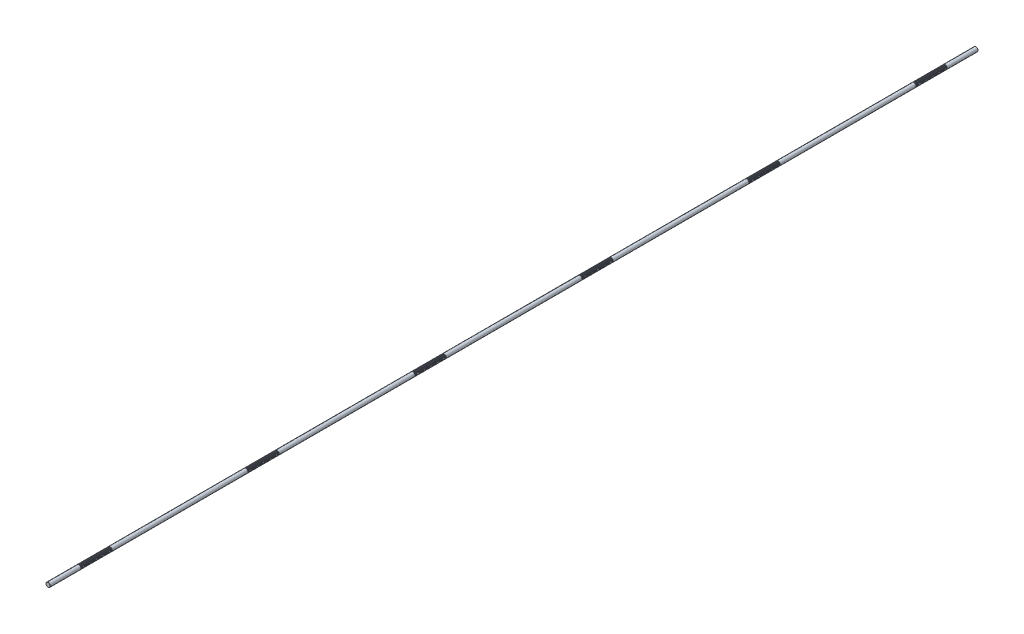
from build123d import *

# Parameters (mm, degrees)
SKETCH1_R           = 7
BOSS_EXTRUDE1_DEPTH = 1500
CHAMFER1_SIZE       = 0.35
LPATTERN1_COUNT     = 34
LPATTERN1_PITCH     = 3
LPATTERN2_COUNT     = 6
LPATTERN2_PITCH     = 540


with BuildPart() as part:
    # Sketch1 → Boss-Extrude1 (new, symmetric)
    with BuildSketch(Plane.XY):
        Circle(SKETCH1_R)
    extrude(amount=BOSS_EXTRUDE1_DEPTH, both=True)

    # Chamfer1
    chamfer1_edges = [part.edges().sort_by_distance(p)[0] for p in [
        (-7, 0, -1500),
        (-7, 0, 1500),
    ]]
    chamfer(chamfer1_edges, length=CHAMFER1_SIZE)

    # Sketch2 → Cut-Revolve1 (revolve, cut)
    with BuildSketch(Plane(origin=(0, 0, 0), x_dir=(0, 0, -1), z_dir=(1, 0, 0)), mode=Mode.PRIVATE) as cut_revolve1_sk:
        Polygon((1400.234455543, 7), (1398.265544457, 7), (1398.734455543, 5.25), (1399.765544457, 5.25), align=None)
    cut_revolve1 = revolve(cut_revolve1_sk.sketch.rotate(Axis((0, 0, 1500), (0, 0, -1)), 90), axis=Axis((0, 0, 1500), (0, 0, -1)), mode=Mode.SUBTRACT)

    # LPattern1: Cut-Revolve1 ×34
    with Locations(*[(0, 0, i * LPATTERN1_PITCH) for i in range(1, LPATTERN1_COUNT)]):
        add(cut_revolve1, mode=Mode.SUBTRACT)

    # LPattern2: Cut-Revolve1 ×6
    with Locations(*[(0, 0, i * LPATTERN2_PITCH) for i in range(1, LPATTERN2_COUNT)]):
        add(cut_revolve1, mode=Mode.SUBTRACT)

    # LPattern2 copy 1 sketch → LPattern2 copy 1 (revolve, cut)
    with BuildSketch(Plane(origin=(0, 0, 543), x_dir=(0, 0, -1), z_dir=(1, 0, 0))):
        Polygon((1400.234455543, 7), (1398.265544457, 7), (1398.734455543, 5.25), (1399.765544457, 5.25), align=None)
    revolve(axis=Axis((0, 0, 2043), (0, 0, -1)), mode=Mode.SUBTRACT)

    # LPattern2 copy 2 sketch → LPattern2 copy 2 (revolve, cut)
    with BuildSketch(Plane(origin=(0, 0, 1083), x_dir=(0, 0, -1), z_dir=(1, 0, 0))):
        Polygon((1400.234455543, 7), (1398.265544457, 7), (1398.734455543, 5.25), (1399.765544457, 5.25), align=None)
    revolve(axis=Axis((0, 0, 2583), (0, 0, -1)), mode=Mode.SUBTRACT)

    # LPattern2 copy 3 sketch → LPattern2 copy 3 (revolve, cut)
    with BuildSketch(Plane(origin=(0, 0, 1623), x_dir=(0, 0, -1), z_dir=(1, 0, 0))):
        Polygon((1400.234455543, 7), (1398.265544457, 7), (1398.734455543, 5.25), (1399.765544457, 5.25), align=None)
    revolve(axis=Axis((0, 0, 3123), (0, 0, -1)), mode=Mode.SUBTRACT)

    # LPattern2 copy 4 sketch → LPattern2 copy 4 (revolve, cut)
    with BuildSketch(Plane(origin=(0, 0, 2163), x_dir=(0, 0, -1), z_dir=(1, 0, 0))):
        Polygon((1400.234455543, 7), (1398.265544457, 7), (1398.734455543, 5.25), (1399.765544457, 5.25), align=None)
    revolve(axis=Axis((0, 0, 3663), (0, 0, -1)), mode=Mode.SUBTRACT)

    # LPattern2 copy 5 sketch → LPattern2 copy 5 (revolve, cut)
    with BuildSketch(Plane(origin=(0, 0, 2703), x_dir=(0, 0, -1), z_dir=(1, 0, 0))):
        Polygon((1400.234455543, 7), (1398.265544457, 7), (1398.734455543, 5.25), (1399.765544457, 5.25), align=None)
    revolve(axis=Axis((0, 0, 4203), (0, 0, -1)), mode=Mode.SUBTRACT)

    # LPattern2 copy 6 sketch → LPattern2 copy 6 (revolve, cut)
    with BuildSketch(Plane(origin=(0, 0, 546), x_dir=(0, 0, -1), z_dir=(1, 0, 0))):
        Polygon((1400.234455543, 7), (1398.265544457, 7), (1398.734455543, 5.25), (1399.765544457, 5.25), align=None)
    revolve(axis=Axis((0, 0, 2046), (0, 0, -1)), mode=Mode.SUBTRACT)

    # LPattern2 copy 7 sketch → LPattern2 copy 7 (revolve, cut)
    with BuildSketch(Plane(origin=(0, 0, 1086), x_dir=(0, 0, -1), z_dir=(1, 0, 0))):
        Polygon((1400.234455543, 7), (1398.265544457, 7), (1398.734455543, 5.25), (1399.765544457, 5.25), align=None)
    revolve(axis=Axis((0, 0, 2586), (0, 0, -1)), mode=Mode.SUBTRACT)

    # LPattern2 copy 8 sketch → LPattern2 copy 8 (revolve, cut)
    with BuildSketch(Plane(origin=(0, 0, 1626), x_dir=(0, 0, -1), z_dir=(1, 0, 0))):
        Polygon((1400.234455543, 7), (1398.265544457, 7), (1398.734455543, 5.25), (1399.765544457, 5.25), align=None)
    revolve(axis=Axis((0, 0, 3126), (0, 0, -1)), mode=Mode.SUBTRACT)

    # LPattern2 copy 9 sketch → LPattern2 copy 9 (revolve, cut)
    with BuildSketch(Plane(origin=(0, 0, 2166), x_dir=(0, 0, -1), z_dir=(1, 0, 0))):
        Polygon((1400.234455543, 7), (1398.265544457, 7), (1398.734455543, 5.25), (1399.765544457, 5.25), align=None)
    revolve(axis=Axis((0, 0, 3666), (0, 0, -1)), mode=Mode.SUBTRACT)

    # LPattern2 copy 10 sketch → LPattern2 copy 10 (revolve, cut)
    with BuildSketch(Plane(origin=(0, 0, 2706), x_dir=(0, 0, -1), z_dir=(1, 0, 0))):
        Polygon((1400.234455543, 7), (1398.265544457, 7), (1398.734455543, 5.25), (1399.765544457, 5.25), align=None)
    revolve(axis=Axis((0, 0, 4206), (0, 0, -1)), mode=Mode.SUBTRACT)

    # LPattern2 copy 11 sketch → LPattern2 copy 11 (revolve, cut)
    with BuildSketch(Plane(origin=(0, 0, 549), x_dir=(0, 0, -1), z_dir=(1, 0, 0))):
        Polygon((1400.234455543, 7), (1398.265544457, 7), (1398.734455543, 5.25), (1399.765544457, 5.25), align=None)
    revolve(axis=Axis((0, 0, 2049), (0, 0, -1)), mode=Mode.SUBTRACT)

    # LPattern2 copy 12 sketch → LPattern2 copy 12 (revolve, cut)
    with BuildSketch(Plane(origin=(0, 0, 1089), x_dir=(0, 0, -1), z_dir=(1, 0, 0))):
        Polygon((1400.234455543, 7), (1398.265544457, 7), (1398.734455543, 5.25), (1399.765544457, 5.25), align=None)
    revolve(axis=Axis((0, 0, 2589), (0, 0, -1)), mode=Mode.SUBTRACT)

    # LPattern2 copy 13 sketch → LPattern2 copy 13 (revolve, cut)
    with BuildSketch(Plane(origin=(0, 0, 1629), x_dir=(0, 0, -1), z_dir=(1, 0, 0))):
        Polygon((1400.234455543, 7), (1398.265544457, 7), (1398.734455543, 5.25), (1399.765544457, 5.25), align=None)
    revolve(axis=Axis((0, 0, 3129), (0, 0, -1)), mode=Mode.SUBTRACT)

    # LPattern2 copy 14 sketch → LPattern2 copy 14 (revolve, cut)
    with BuildSketch(Plane(origin=(0, 0, 2169), x_dir=(0, 0, -1), z_dir=(1, 0, 0))):
        Polygon((1400.234455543, 7), (1398.265544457, 7), (1398.734455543, 5.25), (1399.765544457, 5.25), align=None)
    revolve(axis=Axis((0, 0, 3669), (0, 0, -1)), mode=Mode.SUBTRACT)

    # LPattern2 copy 15 sketch → LPattern2 copy 15 (revolve, cut)
    with BuildSketch(Plane(origin=(0, 0, 2709), x_dir=(0, 0, -1), z_dir=(1, 0, 0))):
        Polygon((1400.234455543, 7), (1398.265544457, 7), (1398.734455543, 5.25), (1399.765544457, 5.25), align=None)
    revolve(axis=Axis((0, 0, 4209), (0, 0, -1)), mode=Mode.SUBTRACT)

    # LPattern2 copy 16 sketch → LPattern2 copy 16 (revolve, cut)
    with BuildSketch(Plane(origin=(0, 0, 552), x_dir=(0, 0, -1), z_dir=(1, 0, 0))):
        Polygon((1400.234455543, 7), (1398.265544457, 7), (1398.734455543, 5.25), (1399.765544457, 5.25), align=None)
    revolve(axis=Axis((0, 0, 2052), (0, 0, -1)), mode=Mode.SUBTRACT)

    # LPattern2 copy 17 sketch → LPattern2 copy 17 (revolve, cut)
    with BuildSketch(Plane(origin=(0, 0, 1092), x_dir=(0, 0, -1), z_dir=(1, 0, 0))):
        Polygon((1400.234455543, 7), (1398.265544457, 7), (1398.734455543, 5.25), (1399.765544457, 5.25), align=None)
    revolve(axis=Axis((0, 0, 2592), (0, 0, -1)), mode=Mode.SUBTRACT)

    # LPattern2 copy 18 sketch → LPattern2 copy 18 (revolve, cut)
    with BuildSketch(Plane(origin=(0, 0, 1632), x_dir=(0, 0, -1), z_dir=(1, 0, 0))):
        Polygon((1400.234455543, 7), (1398.265544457, 7), (1398.734455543, 5.25), (1399.765544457, 5.25), align=None)
    revolve(axis=Axis((0, 0, 3132), (0, 0, -1)), mode=Mode.SUBTRACT)

    # LPattern2 copy 19 sketch → LPattern2 copy 19 (revolve, cut)
    with BuildSketch(Plane(origin=(0, 0, 2172), x_dir=(0, 0, -1), z_dir=(1, 0, 0))):
        Polygon((1400.234455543, 7), (1398.265544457, 7), (1398.734455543, 5.25), (1399.765544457, 5.25), align=None)
    revolve(axis=Axis((0, 0, 3672), (0, 0, -1)), mode=Mode.SUBTRACT)

    # LPattern2 copy 20 sketch → LPattern2 copy 20 (revolve, cut)
    with BuildSketch(Plane(origin=(0, 0, 2712), x_dir=(0, 0, -1), z_dir=(1, 0, 0))):
        Polygon((1400.234455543, 7), (1398.265544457, 7), (1398.734455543, 5.25), (1399.765544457, 5.25), align=None)
    revolve(axis=Axis((0, 0, 4212), (0, 0, -1)), mode=Mode.SUBTRACT)

    # LPattern2 copy 21 sketch → LPattern2 copy 21 (revolve, cut)
    with BuildSketch(Plane(origin=(0, 0, 555), x_dir=(0, 0, -1), z_dir=(1, 0, 0))):
        Polygon((1400.234455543, 7), (1398.265544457, 7), (1398.734455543, 5.25), (1399.765544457, 5.25), align=None)
    revolve(axis=Axis((0, 0, 2055), (0, 0, -1)), mode=Mode.SUBTRACT)

    # LPattern2 copy 22 sketch → LPattern2 copy 22 (revolve, cut)
    with BuildSketch(Plane(origin=(0, 0, 1095), x_dir=(0, 0, -1), z_dir=(1, 0, 0))):
        Polygon((1400.234455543, 7), (1398.265544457, 7), (1398.734455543, 5.25), (1399.765544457, 5.25), align=None)
    revolve(axis=Axis((0, 0, 2595), (0, 0, -1)), mode=Mode.SUBTRACT)

    # LPattern2 copy 23 sketch → LPattern2 copy 23 (revolve, cut)
    with BuildSketch(Plane(origin=(0, 0, 1635), x_dir=(0, 0, -1), z_dir=(1, 0, 0))):
        Polygon((1400.234455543, 7), (1398.265544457, 7), (1398.734455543, 5.25), (1399.765544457, 5.25), align=None)
    revolve(axis=Axis((0, 0, 3135), (0, 0, -1)), mode=Mode.SUBTRACT)

    # LPattern2 copy 24 sketch → LPattern2 copy 24 (revolve, cut)
    with BuildSketch(Plane(origin=(0, 0, 2175), x_dir=(0, 0, -1), z_dir=(1, 0, 0))):
        Polygon((1400.234455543, 7), (1398.265544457, 7), (1398.734455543, 5.25), (1399.765544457, 5.25), align=None)
    revolve(axis=Axis((0, 0, 3675), (0, 0, -1)), mode=Mode.SUBTRACT)

    # LPattern2 copy 25 sketch → LPattern2 copy 25 (revolve, cut)
    with BuildSketch(Plane(origin=(0, 0, 2715), x_dir=(0, 0, -1), z_dir=(1, 0, 0))):
        Polygon((1400.234455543, 7), (1398.265544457, 7), (1398.734455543, 5.25), (1399.765544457, 5.25), align=None)
    revolve(axis=Axis((0, 0, 4215), (0, 0, -1)), mode=Mode.SUBTRACT)

    # LPattern2 copy 26 sketch → LPattern2 copy 26 (revolve, cut)
    with BuildSketch(Plane(origin=(0, 0, 558), x_dir=(0, 0, -1), z_dir=(1, 0, 0))):
        Polygon((1400.234455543, 7), (1398.265544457, 7), (1398.734455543, 5.25), (1399.765544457, 5.25), align=None)
    revolve(axis=Axis((0, 0, 2058), (0, 0, -1)), mode=Mode.SUBTRACT)

    # LPattern2 copy 27 sketch → LPattern2 copy 27 (revolve, cut)
    with BuildSketch(Plane(origin=(0, 0, 1098), x_dir=(0, 0, -1), z_dir=(1, 0, 0))):
        Polygon((1400.234455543, 7), (1398.265544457, 7), (1398.734455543, 5.25), (1399.765544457, 5.25), align=None)
    revolve(axis=Axis((0, 0, 2598), (0, 0, -1)), mode=Mode.SUBTRACT)

    # LPattern2 copy 28 sketch → LPattern2 copy 28 (revolve, cut)
    with BuildSketch(Plane(origin=(0, 0, 1638), x_dir=(0, 0, -1), z_dir=(1, 0, 0))):
        Polygon((1400.234455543, 7), (1398.265544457, 7), (1398.734455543, 5.25), (1399.765544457, 5.25), align=None)
    revolve(axis=Axis((0, 0, 3138), (0, 0, -1)), mode=Mode.SUBTRACT)

    # LPattern2 copy 29 sketch → LPattern2 copy 29 (revolve, cut)
    with BuildSketch(Plane(origin=(0, 0, 2178), x_dir=(0, 0, -1), z_dir=(1, 0, 0))):
        Polygon((1400.234455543, 7), (1398.265544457, 7), (1398.734455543, 5.25), (1399.765544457, 5.25), align=None)
    revolve(axis=Axis((0, 0, 3678), (0, 0, -1)), mode=Mode.SUBTRACT)

    # LPattern2 copy 30 sketch → LPattern2 copy 30 (revolve, cut)
    with BuildSketch(Plane(origin=(0, 0, 2718), x_dir=(0, 0, -1), z_dir=(1, 0, 0))):
        Polygon((1400.234455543, 7), (1398.265544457, 7), (1398.734455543, 5.25), (1399.765544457, 5.25), align=None)
    revolve(axis=Axis((0, 0, 4218), (0, 0, -1)), mode=Mode.SUBTRACT)

    # LPattern2 copy 31 sketch → LPattern2 copy 31 (revolve, cut)
    with BuildSketch(Plane(origin=(0, 0, 561), x_dir=(0, 0, -1), z_dir=(1, 0, 0))):
        Polygon((1400.234455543, 7), (1398.265544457, 7), (1398.734455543, 5.25), (1399.765544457, 5.25), align=None)
    revolve(axis=Axis((0, 0, 2061), (0, 0, -1)), mode=Mode.SUBTRACT)

    # LPattern2 copy 32 sketch → LPattern2 copy 32 (revolve, cut)
    with BuildSketch(Plane(origin=(0, 0, 1101), x_dir=(0, 0, -1), z_dir=(1, 0, 0))):
        Polygon((1400.234455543, 7), (1398.265544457, 7), (1398.734455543, 5.25), (1399.765544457, 5.25), align=None)
    revolve(axis=Axis((0, 0, 2601), (0, 0, -1)), mode=Mode.SUBTRACT)

    # LPattern2 copy 33 sketch → LPattern2 copy 33 (revolve, cut)
    with BuildSketch(Plane(origin=(0, 0, 1641), x_dir=(0, 0, -1), z_dir=(1, 0, 0))):
        Polygon((1400.234455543, 7), (1398.265544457, 7), (1398.734455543, 5.25), (1399.765544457, 5.25), align=None)
    revolve(axis=Axis((0, 0, 3141), (0, 0, -1)), mode=Mode.SUBTRACT)

    # LPattern2 copy 34 sketch → LPattern2 copy 34 (revolve, cut)
    with BuildSketch(Plane(origin=(0, 0, 2181), x_dir=(0, 0, -1), z_dir=(1, 0, 0))):
        Polygon((1400.234455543, 7), (1398.265544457, 7), (1398.734455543, 5.25), (1399.765544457, 5.25), align=None)
    revolve(axis=Axis((0, 0, 3681), (0, 0, -1)), mode=Mode.SUBTRACT)

    # LPattern2 copy 35 sketch → LPattern2 copy 35 (revolve, cut)
    with BuildSketch(Plane(origin=(0, 0, 2721), x_dir=(0, 0, -1), z_dir=(1, 0, 0))):
        Polygon((1400.234455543, 7), (1398.265544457, 7), (1398.734455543, 5.25), (1399.765544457, 5.25), align=None)
    revolve(axis=Axis((0, 0, 4221), (0, 0, -1)), mode=Mode.SUBTRACT)

    # LPattern2 copy 36 sketch → LPattern2 copy 36 (revolve, cut)
    with BuildSketch(Plane(origin=(0, 0, 564), x_dir=(0, 0, -1), z_dir=(1, 0, 0))):
        Polygon((1400.234455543, 7), (1398.265544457, 7), (1398.734455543, 5.25), (1399.765544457, 5.25), align=None)
    revolve(axis=Axis((0, 0, 2064), (0, 0, -1)), mode=Mode.SUBTRACT)

    # LPattern2 copy 37 sketch → LPattern2 copy 37 (revolve, cut)
    with BuildSketch(Plane(origin=(0, 0, 1104), x_dir=(0, 0, -1), z_dir=(1, 0, 0))):
        Polygon((1400.234455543, 7), (1398.265544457, 7), (1398.734455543, 5.25), (1399.765544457, 5.25), align=None)
    revolve(axis=Axis((0, 0, 2604), (0, 0, -1)), mode=Mode.SUBTRACT)

    # LPattern2 copy 38 sketch → LPattern2 copy 38 (revolve, cut)
    with BuildSketch(Plane(origin=(0, 0, 1644), x_dir=(0, 0, -1), z_dir=(1, 0, 0))):
        Polygon((1400.234455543, 7), (1398.265544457, 7), (1398.734455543, 5.25), (1399.765544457, 5.25), align=None)
    revolve(axis=Axis((0, 0, 3144), (0, 0, -1)), mode=Mode.SUBTRACT)

    # LPattern2 copy 39 sketch → LPattern2 copy 39 (revolve, cut)
    with BuildSketch(Plane(origin=(0, 0, 2184), x_dir=(0, 0, -1), z_dir=(1, 0, 0))):
        Polygon((1400.234455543, 7), (1398.265544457, 7), (1398.734455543, 5.25), (1399.765544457, 5.25), align=None)
    revolve(axis=Axis((0, 0, 3684), (0, 0, -1)), mode=Mode.SUBTRACT)

    # LPattern2 copy 40 sketch → LPattern2 copy 40 (revolve, cut)
    with BuildSketch(Plane(origin=(0, 0, 2724), x_dir=(0, 0, -1), z_dir=(1, 0, 0))):
        Polygon((1400.234455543, 7), (1398.265544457, 7), (1398.734455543, 5.25), (1399.765544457, 5.25), align=None)
    revolve(axis=Axis((0, 0, 4224), (0, 0, -1)), mode=Mode.SUBTRACT)

    # LPattern2 copy 41 sketch → LPattern2 copy 41 (revolve, cut)
    with BuildSketch(Plane(origin=(0, 0, 567), x_dir=(0, 0, -1), z_dir=(1, 0, 0))):
        Polygon((1400.234455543, 7), (1398.265544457, 7), (1398.734455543, 5.25), (1399.765544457, 5.25), align=None)
    revolve(axis=Axis((0, 0, 2067), (0, 0, -1)), mode=Mode.SUBTRACT)

    # LPattern2 copy 42 sketch → LPattern2 copy 42 (revolve, cut)
    with BuildSketch(Plane(origin=(0, 0, 1107), x_dir=(0, 0, -1), z_dir=(1, 0, 0))):
        Polygon((1400.234455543, 7), (1398.265544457, 7), (1398.734455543, 5.25), (1399.765544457, 5.25), align=None)
    revolve(axis=Axis((0, 0, 2607), (0, 0, -1)), mode=Mode.SUBTRACT)

    # LPattern2 copy 43 sketch → LPattern2 copy 43 (revolve, cut)
    with BuildSketch(Plane(origin=(0, 0, 1647), x_dir=(0, 0, -1), z_dir=(1, 0, 0))):
        Polygon((1400.234455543, 7), (1398.265544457, 7), (1398.734455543, 5.25), (1399.765544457, 5.25), align=None)
    revolve(axis=Axis((0, 0, 3147), (0, 0, -1)), mode=Mode.SUBTRACT)

    # LPattern2 copy 44 sketch → LPattern2 copy 44 (revolve, cut)
    with BuildSketch(Plane(origin=(0, 0, 2187), x_dir=(0, 0, -1), z_dir=(1, 0, 0))):
        Polygon((1400.234455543, 7), (1398.265544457, 7), (1398.734455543, 5.25), (1399.765544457, 5.25), align=None)
    revolve(axis=Axis((0, 0, 3687), (0, 0, -1)), mode=Mode.SUBTRACT)

    # LPattern2 copy 45 sketch → LPattern2 copy 45 (revolve, cut)
    with BuildSketch(Plane(origin=(0, 0, 2727), x_dir=(0, 0, -1), z_dir=(1, 0, 0))):
        Polygon((1400.234455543, 7), (1398.265544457, 7), (1398.734455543, 5.25), (1399.765544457, 5.25), align=None)
    revolve(axis=Axis((0, 0, 4227), (0, 0, -1)), mode=Mode.SUBTRACT)

    # LPattern2 copy 46 sketch → LPattern2 copy 46 (revolve, cut)
    with BuildSketch(Plane(origin=(0, 0, 570), x_dir=(0, 0, -1), z_dir=(1, 0, 0))):
        Polygon((1400.234455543, 7), (1398.265544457, 7), (1398.734455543, 5.25), (1399.765544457, 5.25), align=None)
    revolve(axis=Axis((0, 0, 2070), (0, 0, -1)), mode=Mode.SUBTRACT)

    # LPattern2 copy 47 sketch → LPattern2 copy 47 (revolve, cut)
    with BuildSketch(Plane(origin=(0, 0, 1110), x_dir=(0, 0, -1), z_dir=(1, 0, 0))):
        Polygon((1400.234455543, 7), (1398.265544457, 7), (1398.734455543, 5.25), (1399.765544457, 5.25), align=None)
    revolve(axis=Axis((0, 0, 2610), (0, 0, -1)), mode=Mode.SUBTRACT)

    # LPattern2 copy 48 sketch → LPattern2 copy 48 (revolve, cut)
    with BuildSketch(Plane(origin=(0, 0, 1650), x_dir=(0, 0, -1), z_dir=(1, 0, 0))):
        Polygon((1400.234455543, 7), (1398.265544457, 7), (1398.734455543, 5.25), (1399.765544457, 5.25), align=None)
    revolve(axis=Axis((0, 0, 3150), (0, 0, -1)), mode=Mode.SUBTRACT)

    # LPattern2 copy 49 sketch → LPattern2 copy 49 (revolve, cut)
    with BuildSketch(Plane(origin=(0, 0, 2190), x_dir=(0, 0, -1), z_dir=(1, 0, 0))):
        Polygon((1400.234455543, 7), (1398.265544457, 7), (1398.734455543, 5.25), (1399.765544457, 5.25), align=None)
    revolve(axis=Axis((0, 0, 3690), (0, 0, -1)), mode=Mode.SUBTRACT)

    # LPattern2 copy 50 sketch → LPattern2 copy 50 (revolve, cut)
    with BuildSketch(Plane(origin=(0, 0, 2730), x_dir=(0, 0, -1), z_dir=(1, 0, 0))):
        Polygon((1400.234455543, 7), (1398.265544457, 7), (1398.734455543, 5.25), (1399.765544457, 5.25), align=None)
    revolve(axis=Axis((0, 0, 4230), (0, 0, -1)), mode=Mode.SUBTRACT)

    # LPattern2 copy 51 sketch → LPattern2 copy 51 (revolve, cut)
    with BuildSketch(Plane(origin=(0, 0, 573), x_dir=(0, 0, -1), z_dir=(1, 0, 0))):
        Polygon((1400.234455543, 7), (1398.265544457, 7), (1398.734455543, 5.25), (1399.765544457, 5.25), align=None)
    revolve(axis=Axis((0, 0, 2073), (0, 0, -1)), mode=Mode.SUBTRACT)

    # LPattern2 copy 52 sketch → LPattern2 copy 52 (revolve, cut)
    with BuildSketch(Plane(origin=(0, 0, 1113), x_dir=(0, 0, -1), z_dir=(1, 0, 0))):
        Polygon((1400.234455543, 7), (1398.265544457, 7), (1398.734455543, 5.25), (1399.765544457, 5.25), align=None)
    revolve(axis=Axis((0, 0, 2613), (0, 0, -1)), mode=Mode.SUBTRACT)

    # LPattern2 copy 53 sketch → LPattern2 copy 53 (revolve, cut)
    with BuildSketch(Plane(origin=(0, 0, 1653), x_dir=(0, 0, -1), z_dir=(1, 0, 0))):
        Polygon((1400.234455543, 7), (1398.265544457, 7), (1398.734455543, 5.25), (1399.765544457, 5.25), align=None)
    revolve(axis=Axis((0, 0, 3153), (0, 0, -1)), mode=Mode.SUBTRACT)

    # LPattern2 copy 54 sketch → LPattern2 copy 54 (revolve, cut)
    with BuildSketch(Plane(origin=(0, 0, 2193), x_dir=(0, 0, -1), z_dir=(1, 0, 0))):
        Polygon((1400.234455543, 7), (1398.265544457, 7), (1398.734455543, 5.25), (1399.765544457, 5.25), align=None)
    revolve(axis=Axis((0, 0, 3693), (0, 0, -1)), mode=Mode.SUBTRACT)

    # LPattern2 copy 55 sketch → LPattern2 copy 55 (revolve, cut)
    with BuildSketch(Plane(origin=(0, 0, 2733), x_dir=(0, 0, -1), z_dir=(1, 0, 0))):
        Polygon((1400.234455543, 7), (1398.265544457, 7), (1398.734455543, 5.25), (1399.765544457, 5.25), align=None)
    revolve(axis=Axis((0, 0, 4233), (0, 0, -1)), mode=Mode.SUBTRACT)

    # LPattern2 copy 56 sketch → LPattern2 copy 56 (revolve, cut)
    with BuildSketch(Plane(origin=(0, 0, 576), x_dir=(0, 0, -1), z_dir=(1, 0, 0))):
        Polygon((1400.234455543, 7), (1398.265544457, 7), (1398.734455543, 5.25), (1399.765544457, 5.25), align=None)
    revolve(axis=Axis((0, 0, 2076), (0, 0, -1)), mode=Mode.SUBTRACT)

    # LPattern2 copy 57 sketch → LPattern2 copy 57 (revolve, cut)
    with BuildSketch(Plane(origin=(0, 0, 1116), x_dir=(0, 0, -1), z_dir=(1, 0, 0))):
        Polygon((1400.234455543, 7), (1398.265544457, 7), (1398.734455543, 5.25), (1399.765544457, 5.25), align=None)
    revolve(axis=Axis((0, 0, 2616), (0, 0, -1)), mode=Mode.SUBTRACT)

    # LPattern2 copy 58 sketch → LPattern2 copy 58 (revolve, cut)
    with BuildSketch(Plane(origin=(0, 0, 1656), x_dir=(0, 0, -1), z_dir=(1, 0, 0))):
        Polygon((1400.234455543, 7), (1398.265544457, 7), (1398.734455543, 5.25), (1399.765544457, 5.25), align=None)
    revolve(axis=Axis((0, 0, 3156), (0, 0, -1)), mode=Mode.SUBTRACT)

    # LPattern2 copy 59 sketch → LPattern2 copy 59 (revolve, cut)
    with BuildSketch(Plane(origin=(0, 0, 2196), x_dir=(0, 0, -1), z_dir=(1, 0, 0))):
        Polygon((1400.234455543, 7), (1398.265544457, 7), (1398.734455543, 5.25), (1399.765544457, 5.25), align=None)
    revolve(axis=Axis((0, 0, 3696), (0, 0, -1)), mode=Mode.SUBTRACT)

    # LPattern2 copy 60 sketch → LPattern2 copy 60 (revolve, cut)
    with BuildSketch(Plane(origin=(0, 0, 2736), x_dir=(0, 0, -1), z_dir=(1, 0, 0))):
        Polygon((1400.234455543, 7), (1398.265544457, 7), (1398.734455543, 5.25), (1399.765544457, 5.25), align=None)
    revolve(axis=Axis((0, 0, 4236), (0, 0, -1)), mode=Mode.SUBTRACT)

    # LPattern2 copy 61 sketch → LPattern2 copy 61 (revolve, cut)
    with BuildSketch(Plane(origin=(0, 0, 579), x_dir=(0, 0, -1), z_dir=(1, 0, 0))):
        Polygon((1400.234455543, 7), (1398.265544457, 7), (1398.734455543, 5.25), (1399.765544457, 5.25), align=None)
    revolve(axis=Axis((0, 0, 2079), (0, 0, -1)), mode=Mode.SUBTRACT)

    # LPattern2 copy 62 sketch → LPattern2 copy 62 (revolve, cut)
    with BuildSketch(Plane(origin=(0, 0, 1119), x_dir=(0, 0, -1), z_dir=(1, 0, 0))):
        Polygon((1400.234455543, 7), (1398.265544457, 7), (1398.734455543, 5.25), (1399.765544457, 5.25), align=None)
    revolve(axis=Axis((0, 0, 2619), (0, 0, -1)), mode=Mode.SUBTRACT)

    # LPattern2 copy 63 sketch → LPattern2 copy 63 (revolve, cut)
    with BuildSketch(Plane(origin=(0, 0, 1659), x_dir=(0, 0, -1), z_dir=(1, 0, 0))):
        Polygon((1400.234455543, 7), (1398.265544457, 7), (1398.734455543, 5.25), (1399.765544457, 5.25), align=None)
    revolve(axis=Axis((0, 0, 3159), (0, 0, -1)), mode=Mode.SUBTRACT)

    # LPattern2 copy 64 sketch → LPattern2 copy 64 (revolve, cut)
    with BuildSketch(Plane(origin=(0, 0, 2199), x_dir=(0, 0, -1), z_dir=(1, 0, 0))):
        Polygon((1400.234455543, 7), (1398.265544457, 7), (1398.734455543, 5.25), (1399.765544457, 5.25), align=None)
    revolve(axis=Axis((0, 0, 3699), (0, 0, -1)), mode=Mode.SUBTRACT)

    # LPattern2 copy 65 sketch → LPattern2 copy 65 (revolve, cut)
    with BuildSketch(Plane(origin=(0, 0, 2739), x_dir=(0, 0, -1), z_dir=(1, 0, 0))):
        Polygon((1400.234455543, 7), (1398.265544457, 7), (1398.734455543, 5.25), (1399.765544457, 5.25), align=None)
    revolve(axis=Axis((0, 0, 4239), (0, 0, -1)), mode=Mode.SUBTRACT)

    # LPattern2 copy 66 sketch → LPattern2 copy 66 (revolve, cut)
    with BuildSketch(Plane(origin=(0, 0, 582), x_dir=(0, 0, -1), z_dir=(1, 0, 0))):
        Polygon((1400.234455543, 7), (1398.265544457, 7), (1398.734455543, 5.25), (1399.765544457, 5.25), align=None)
    revolve(axis=Axis((0, 0, 2082), (0, 0, -1)), mode=Mode.SUBTRACT)

    # LPattern2 copy 67 sketch → LPattern2 copy 67 (revolve, cut)
    with BuildSketch(Plane(origin=(0, 0, 1122), x_dir=(0, 0, -1), z_dir=(1, 0, 0))):
        Polygon((1400.234455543, 7), (1398.265544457, 7), (1398.734455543, 5.25), (1399.765544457, 5.25), align=None)
    revolve(axis=Axis((0, 0, 2622), (0, 0, -1)), mode=Mode.SUBTRACT)

    # LPattern2 copy 68 sketch → LPattern2 copy 68 (revolve, cut)
    with BuildSketch(Plane(origin=(0, 0, 1662), x_dir=(0, 0, -1), z_dir=(1, 0, 0))):
        Polygon((1400.234455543, 7), (1398.265544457, 7), (1398.734455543, 5.25), (1399.765544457, 5.25), align=None)
    revolve(axis=Axis((0, 0, 3162), (0, 0, -1)), mode=Mode.SUBTRACT)

    # LPattern2 copy 69 sketch → LPattern2 copy 69 (revolve, cut)
    with BuildSketch(Plane(origin=(0, 0, 2202), x_dir=(0, 0, -1), z_dir=(1, 0, 0))):
        Polygon((1400.234455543, 7), (1398.265544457, 7), (1398.734455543, 5.25), (1399.765544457, 5.25), align=None)
    revolve(axis=Axis((0, 0, 3702), (0, 0, -1)), mode=Mode.SUBTRACT)

    # LPattern2 copy 70 sketch → LPattern2 copy 70 (revolve, cut)
    with BuildSketch(Plane(origin=(0, 0, 2742), x_dir=(0, 0, -1), z_dir=(1, 0, 0))):
        Polygon((1400.234455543, 7), (1398.265544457, 7), (1398.734455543, 5.25), (1399.765544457, 5.25), align=None)
    revolve(axis=Axis((0, 0, 4242), (0, 0, -1)), mode=Mode.SUBTRACT)

    # LPattern2 copy 71 sketch → LPattern2 copy 71 (revolve, cut)
    with BuildSketch(Plane(origin=(0, 0, 585), x_dir=(0, 0, -1), z_dir=(1, 0, 0))):
        Polygon((1400.234455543, 7), (1398.265544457, 7), (1398.734455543, 5.25), (1399.765544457, 5.25), align=None)
    revolve(axis=Axis((0, 0, 2085), (0, 0, -1)), mode=Mode.SUBTRACT)

    # LPattern2 copy 72 sketch → LPattern2 copy 72 (revolve, cut)
    with BuildSketch(Plane(origin=(0, 0, 1125), x_dir=(0, 0, -1), z_dir=(1, 0, 0))):
        Polygon((1400.234455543, 7), (1398.265544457, 7), (1398.734455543, 5.25), (1399.765544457, 5.25), align=None)
    revolve(axis=Axis((0, 0, 2625), (0, 0, -1)), mode=Mode.SUBTRACT)

    # LPattern2 copy 73 sketch → LPattern2 copy 73 (revolve, cut)
    with BuildSketch(Plane(origin=(0, 0, 1665), x_dir=(0, 0, -1), z_dir=(1, 0, 0))):
        Polygon((1400.234455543, 7), (1398.265544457, 7), (1398.734455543, 5.25), (1399.765544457, 5.25), align=None)
    revolve(axis=Axis((0, 0, 3165), (0, 0, -1)), mode=Mode.SUBTRACT)

    # LPattern2 copy 74 sketch → LPattern2 copy 74 (revolve, cut)
    with BuildSketch(Plane(origin=(0, 0, 2205), x_dir=(0, 0, -1), z_dir=(1, 0, 0))):
        Polygon((1400.234455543, 7), (1398.265544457, 7), (1398.734455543, 5.25), (1399.765544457, 5.25), align=None)
    revolve(axis=Axis((0, 0, 3705), (0, 0, -1)), mode=Mode.SUBTRACT)

    # LPattern2 copy 75 sketch → LPattern2 copy 75 (revolve, cut)
    with BuildSketch(Plane(origin=(0, 0, 2745), x_dir=(0, 0, -1), z_dir=(1, 0, 0))):
        Polygon((1400.234455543, 7), (1398.265544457, 7), (1398.734455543, 5.25), (1399.765544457, 5.25), align=None)
    revolve(axis=Axis((0, 0, 4245), (0, 0, -1)), mode=Mode.SUBTRACT)

    # LPattern2 copy 76 sketch → LPattern2 copy 76 (revolve, cut)
    with BuildSketch(Plane(origin=(0, 0, 588), x_dir=(0, 0, -1), z_dir=(1, 0, 0))):
        Polygon((1400.234455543, 7), (1398.265544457, 7), (1398.734455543, 5.25), (1399.765544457, 5.25), align=None)
    revolve(axis=Axis((0, 0, 2088), (0, 0, -1)), mode=Mode.SUBTRACT)

    # LPattern2 copy 77 sketch → LPattern2 copy 77 (revolve, cut)
    with BuildSketch(Plane(origin=(0, 0, 1128), x_dir=(0, 0, -1), z_dir=(1, 0, 0))):
        Polygon((1400.234455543, 7), (1398.265544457, 7), (1398.734455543, 5.25), (1399.765544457, 5.25), align=None)
    revolve(axis=Axis((0, 0, 2628), (0, 0, -1)), mode=Mode.SUBTRACT)

    # LPattern2 copy 78 sketch → LPattern2 copy 78 (revolve, cut)
    with BuildSketch(Plane(origin=(0, 0, 1668), x_dir=(0, 0, -1), z_dir=(1, 0, 0))):
        Polygon((1400.234455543, 7), (1398.265544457, 7), (1398.734455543, 5.25), (1399.765544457, 5.25), align=None)
    revolve(axis=Axis((0, 0, 3168), (0, 0, -1)), mode=Mode.SUBTRACT)

    # LPattern2 copy 79 sketch → LPattern2 copy 79 (revolve, cut)
    with BuildSketch(Plane(origin=(0, 0, 2208), x_dir=(0, 0, -1), z_dir=(1, 0, 0))):
        Polygon((1400.234455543, 7), (1398.265544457, 7), (1398.734455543, 5.25), (1399.765544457, 5.25), align=None)
    revolve(axis=Axis((0, 0, 3708), (0, 0, -1)), mode=Mode.SUBTRACT)

    # LPattern2 copy 80 sketch → LPattern2 copy 80 (revolve, cut)
    with BuildSketch(Plane(origin=(0, 0, 2748), x_dir=(0, 0, -1), z_dir=(1, 0, 0))):
        Polygon((1400.234455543, 7), (1398.265544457, 7), (1398.734455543, 5.25), (1399.765544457, 5.25), align=None)
    revolve(axis=Axis((0, 0, 4248), (0, 0, -1)), mode=Mode.SUBTRACT)

    # LPattern2 copy 81 sketch → LPattern2 copy 81 (revolve, cut)
    with BuildSketch(Plane(origin=(0, 0, 591), x_dir=(0, 0, -1), z_dir=(1, 0, 0))):
        Polygon((1400.234455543, 7), (1398.265544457, 7), (1398.734455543, 5.25), (1399.765544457, 5.25), align=None)
    revolve(axis=Axis((0, 0, 2091), (0, 0, -1)), mode=Mode.SUBTRACT)

    # LPattern2 copy 82 sketch → LPattern2 copy 82 (revolve, cut)
    with BuildSketch(Plane(origin=(0, 0, 1131), x_dir=(0, 0, -1), z_dir=(1, 0, 0))):
        Polygon((1400.234455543, 7), (1398.265544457, 7), (1398.734455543, 5.25), (1399.765544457, 5.25), align=None)
    revolve(axis=Axis((0, 0, 2631), (0, 0, -1)), mode=Mode.SUBTRACT)

    # LPattern2 copy 83 sketch → LPattern2 copy 83 (revolve, cut)
    with BuildSketch(Plane(origin=(0, 0, 1671), x_dir=(0, 0, -1), z_dir=(1, 0, 0))):
        Polygon((1400.234455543, 7), (1398.265544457, 7), (1398.734455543, 5.25), (1399.765544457, 5.25), align=None)
    revolve(axis=Axis((0, 0, 3171), (0, 0, -1)), mode=Mode.SUBTRACT)

    # LPattern2 copy 84 sketch → LPattern2 copy 84 (revolve, cut)
    with BuildSketch(Plane(origin=(0, 0, 2211), x_dir=(0, 0, -1), z_dir=(1, 0, 0))):
        Polygon((1400.234455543, 7), (1398.265544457, 7), (1398.734455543, 5.25), (1399.765544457, 5.25), align=None)
    revolve(axis=Axis((0, 0, 3711), (0, 0, -1)), mode=Mode.SUBTRACT)

    # LPattern2 copy 85 sketch → LPattern2 copy 85 (revolve, cut)
    with BuildSketch(Plane(origin=(0, 0, 2751), x_dir=(0, 0, -1), z_dir=(1, 0, 0))):
        Polygon((1400.234455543, 7), (1398.265544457, 7), (1398.734455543, 5.25), (1399.765544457, 5.25), align=None)
    revolve(axis=Axis((0, 0, 4251), (0, 0, -1)), mode=Mode.SUBTRACT)

    # LPattern2 copy 86 sketch → LPattern2 copy 86 (revolve, cut)
    with BuildSketch(Plane(origin=(0, 0, 594), x_dir=(0, 0, -1), z_dir=(1, 0, 0))):
        Polygon((1400.234455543, 7), (1398.265544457, 7), (1398.734455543, 5.25), (1399.765544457, 5.25), align=None)
    revolve(axis=Axis((0, 0, 2094), (0, 0, -1)), mode=Mode.SUBTRACT)

    # LPattern2 copy 87 sketch → LPattern2 copy 87 (revolve, cut)
    with BuildSketch(Plane(origin=(0, 0, 1134), x_dir=(0, 0, -1), z_dir=(1, 0, 0))):
        Polygon((1400.234455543, 7), (1398.265544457, 7), (1398.734455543, 5.25), (1399.765544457, 5.25), align=None)
    revolve(axis=Axis((0, 0, 2634), (0, 0, -1)), mode=Mode.SUBTRACT)

    # LPattern2 copy 88 sketch → LPattern2 copy 88 (revolve, cut)
    with BuildSketch(Plane(origin=(0, 0, 1674), x_dir=(0, 0, -1), z_dir=(1, 0, 0))):
        Polygon((1400.234455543, 7), (1398.265544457, 7), (1398.734455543, 5.25), (1399.765544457, 5.25), align=None)
    revolve(axis=Axis((0, 0, 3174), (0, 0, -1)), mode=Mode.SUBTRACT)

    # LPattern2 copy 89 sketch → LPattern2 copy 89 (revolve, cut)
    with BuildSketch(Plane(origin=(0, 0, 2214), x_dir=(0, 0, -1), z_dir=(1, 0, 0))):
        Polygon((1400.234455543, 7), (1398.265544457, 7), (1398.734455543, 5.25), (1399.765544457, 5.25), align=None)
    revolve(axis=Axis((0, 0, 3714), (0, 0, -1)), mode=Mode.SUBTRACT)

    # LPattern2 copy 90 sketch → LPattern2 copy 90 (revolve, cut)
    with BuildSketch(Plane(origin=(0, 0, 2754), x_dir=(0, 0, -1), z_dir=(1, 0, 0))):
        Polygon((1400.234455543, 7), (1398.265544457, 7), (1398.734455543, 5.25), (1399.765544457, 5.25), align=None)
    revolve(axis=Axis((0, 0, 4254), (0, 0, -1)), mode=Mode.SUBTRACT)

    # LPattern2 copy 91 sketch → LPattern2 copy 91 (revolve, cut)
    with BuildSketch(Plane(origin=(0, 0, 597), x_dir=(0, 0, -1), z_dir=(1, 0, 0))):
        Polygon((1400.234455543, 7), (1398.265544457, 7), (1398.734455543, 5.25), (1399.765544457, 5.25), align=None)
    revolve(axis=Axis((0, 0, 2097), (0, 0, -1)), mode=Mode.SUBTRACT)

    # LPattern2 copy 92 sketch → LPattern2 copy 92 (revolve, cut)
    with BuildSketch(Plane(origin=(0, 0, 1137), x_dir=(0, 0, -1), z_dir=(1, 0, 0))):
        Polygon((1400.234455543, 7), (1398.265544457, 7), (1398.734455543, 5.25), (1399.765544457, 5.25), align=None)
    revolve(axis=Axis((0, 0, 2637), (0, 0, -1)), mode=Mode.SUBTRACT)

    # LPattern2 copy 93 sketch → LPattern2 copy 93 (revolve, cut)
    with BuildSketch(Plane(origin=(0, 0, 1677), x_dir=(0, 0, -1), z_dir=(1, 0, 0))):
        Polygon((1400.234455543, 7), (1398.265544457, 7), (1398.734455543, 5.25), (1399.765544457, 5.25), align=None)
    revolve(axis=Axis((0, 0, 3177), (0, 0, -1)), mode=Mode.SUBTRACT)

    # LPattern2 copy 94 sketch → LPattern2 copy 94 (revolve, cut)
    with BuildSketch(Plane(origin=(0, 0, 2217), x_dir=(0, 0, -1), z_dir=(1, 0, 0))):
        Polygon((1400.234455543, 7), (1398.265544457, 7), (1398.734455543, 5.25), (1399.765544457, 5.25), align=None)
    revolve(axis=Axis((0, 0, 3717), (0, 0, -1)), mode=Mode.SUBTRACT)

    # LPattern2 copy 95 sketch → LPattern2 copy 95 (revolve, cut)
    with BuildSketch(Plane(origin=(0, 0, 2757), x_dir=(0, 0, -1), z_dir=(1, 0, 0))):
        Polygon((1400.234455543, 7), (1398.265544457, 7), (1398.734455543, 5.25), (1399.765544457, 5.25), align=None)
    revolve(axis=Axis((0, 0, 4257), (0, 0, -1)), mode=Mode.SUBTRACT)

    # LPattern2 copy 96 sketch → LPattern2 copy 96 (revolve, cut)
    with BuildSketch(Plane(origin=(0, 0, 600), x_dir=(0, 0, -1), z_dir=(1, 0, 0))):
        Polygon((1400.234455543, 7), (1398.265544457, 7), (1398.734455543, 5.25), (1399.765544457, 5.25), align=None)
    revolve(axis=Axis((0, 0, 2100), (0, 0, -1)), mode=Mode.SUBTRACT)

    # LPattern2 copy 97 sketch → LPattern2 copy 97 (revolve, cut)
    with BuildSketch(Plane(origin=(0, 0, 1140), x_dir=(0, 0, -1), z_dir=(1, 0, 0))):
        Polygon((1400.234455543, 7), (1398.265544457, 7), (1398.734455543, 5.25), (1399.765544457, 5.25), align=None)
    revolve(axis=Axis((0, 0, 2640), (0, 0, -1)), mode=Mode.SUBTRACT)

    # LPattern2 copy 98 sketch → LPattern2 copy 98 (revolve, cut)
    with BuildSketch(Plane(origin=(0, 0, 1680), x_dir=(0, 0, -1), z_dir=(1, 0, 0))):
        Polygon((1400.234455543, 7), (1398.265544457, 7), (1398.734455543, 5.25), (1399.765544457, 5.25), align=None)
    revolve(axis=Axis((0, 0, 3180), (0, 0, -1)), mode=Mode.SUBTRACT)

    # LPattern2 copy 99 sketch → LPattern2 copy 99 (revolve, cut)
    with BuildSketch(Plane(origin=(0, 0, 2220), x_dir=(0, 0, -1), z_dir=(1, 0, 0))):
        Polygon((1400.234455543, 7), (1398.265544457, 7), (1398.734455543, 5.25), (1399.765544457, 5.25), align=None)
    revolve(axis=Axis((0, 0, 3720), (0, 0, -1)), mode=Mode.SUBTRACT)

    # LPattern2 copy 100 sketch → LPattern2 copy 100 (revolve, cut)
    with BuildSketch(Plane(origin=(0, 0, 2760), x_dir=(0, 0, -1), z_dir=(1, 0, 0))):
        Polygon((1400.234455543, 7), (1398.265544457, 7), (1398.734455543, 5.25), (1399.765544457, 5.25), align=None)
    revolve(axis=Axis((0, 0, 4260), (0, 0, -1)), mode=Mode.SUBTRACT)

    # LPattern2 copy 101 sketch → LPattern2 copy 101 (revolve, cut)
    with BuildSketch(Plane(origin=(0, 0, 603), x_dir=(0, 0, -1), z_dir=(1, 0, 0))):
        Polygon((1400.234455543, 7), (1398.265544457, 7), (1398.734455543, 5.25), (1399.765544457, 5.25), align=None)
    revolve(axis=Axis((0, 0, 2103), (0, 0, -1)), mode=Mode.SUBTRACT)

    # LPattern2 copy 102 sketch → LPattern2 copy 102 (revolve, cut)
    with BuildSketch(Plane(origin=(0, 0, 1143), x_dir=(0, 0, -1), z_dir=(1, 0, 0))):
        Polygon((1400.234455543, 7), (1398.265544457, 7), (1398.734455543, 5.25), (1399.765544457, 5.25), align=None)
    revolve(axis=Axis((0, 0, 2643), (0, 0, -1)), mode=Mode.SUBTRACT)

    # LPattern2 copy 103 sketch → LPattern2 copy 103 (revolve, cut)
    with BuildSketch(Plane(origin=(0, 0, 1683), x_dir=(0, 0, -1), z_dir=(1, 0, 0))):
        Polygon((1400.234455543, 7), (1398.265544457, 7), (1398.734455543, 5.25), (1399.765544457, 5.25), align=None)
    revolve(axis=Axis((0, 0, 3183), (0, 0, -1)), mode=Mode.SUBTRACT)

    # LPattern2 copy 104 sketch → LPattern2 copy 104 (revolve, cut)
    with BuildSketch(Plane(origin=(0, 0, 2223), x_dir=(0, 0, -1), z_dir=(1, 0, 0))):
        Polygon((1400.234455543, 7), (1398.265544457, 7), (1398.734455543, 5.25), (1399.765544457, 5.25), align=None)
    revolve(axis=Axis((0, 0, 3723), (0, 0, -1)), mode=Mode.SUBTRACT)

    # LPattern2 copy 105 sketch → LPattern2 copy 105 (revolve, cut)
    with BuildSketch(Plane(origin=(0, 0, 2763), x_dir=(0, 0, -1), z_dir=(1, 0, 0))):
        Polygon((1400.234455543, 7), (1398.265544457, 7), (1398.734455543, 5.25), (1399.765544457, 5.25), align=None)
    revolve(axis=Axis((0, 0, 4263), (0, 0, -1)), mode=Mode.SUBTRACT)

    # LPattern2 copy 106 sketch → LPattern2 copy 106 (revolve, cut)
    with BuildSketch(Plane(origin=(0, 0, 606), x_dir=(0, 0, -1), z_dir=(1, 0, 0))):
        Polygon((1400.234455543, 7), (1398.265544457, 7), (1398.734455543, 5.25), (1399.765544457, 5.25), align=None)
    revolve(axis=Axis((0, 0, 2106), (0, 0, -1)), mode=Mode.SUBTRACT)

    # LPattern2 copy 107 sketch → LPattern2 copy 107 (revolve, cut)
    with BuildSketch(Plane(origin=(0, 0, 1146), x_dir=(0, 0, -1), z_dir=(1, 0, 0))):
        Polygon((1400.234455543, 7), (1398.265544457, 7), (1398.734455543, 5.25), (1399.765544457, 5.25), align=None)
    revolve(axis=Axis((0, 0, 2646), (0, 0, -1)), mode=Mode.SUBTRACT)

    # LPattern2 copy 108 sketch → LPattern2 copy 108 (revolve, cut)
    with BuildSketch(Plane(origin=(0, 0, 1686), x_dir=(0, 0, -1), z_dir=(1, 0, 0))):
        Polygon((1400.234455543, 7), (1398.265544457, 7), (1398.734455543, 5.25), (1399.765544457, 5.25), align=None)
    revolve(axis=Axis((0, 0, 3186), (0, 0, -1)), mode=Mode.SUBTRACT)

    # LPattern2 copy 109 sketch → LPattern2 copy 109 (revolve, cut)
    with BuildSketch(Plane(origin=(0, 0, 2226), x_dir=(0, 0, -1), z_dir=(1, 0, 0))):
        Polygon((1400.234455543, 7), (1398.265544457, 7), (1398.734455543, 5.25), (1399.765544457, 5.25), align=None)
    revolve(axis=Axis((0, 0, 3726), (0, 0, -1)), mode=Mode.SUBTRACT)

    # LPattern2 copy 110 sketch → LPattern2 copy 110 (revolve, cut)
    with BuildSketch(Plane(origin=(0, 0, 2766), x_dir=(0, 0, -1), z_dir=(1, 0, 0))):
        Polygon((1400.234455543, 7), (1398.265544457, 7), (1398.734455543, 5.25), (1399.765544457, 5.25), align=None)
    revolve(axis=Axis((0, 0, 4266), (0, 0, -1)), mode=Mode.SUBTRACT)

    # LPattern2 copy 111 sketch → LPattern2 copy 111 (revolve, cut)
    with BuildSketch(Plane(origin=(0, 0, 609), x_dir=(0, 0, -1), z_dir=(1, 0, 0))):
        Polygon((1400.234455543, 7), (1398.265544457, 7), (1398.734455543, 5.25), (1399.765544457, 5.25), align=None)
    revolve(axis=Axis((0, 0, 2109), (0, 0, -1)), mode=Mode.SUBTRACT)

    # LPattern2 copy 112 sketch → LPattern2 copy 112 (revolve, cut)
    with BuildSketch(Plane(origin=(0, 0, 1149), x_dir=(0, 0, -1), z_dir=(1, 0, 0))):
        Polygon((1400.234455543, 7), (1398.265544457, 7), (1398.734455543, 5.25), (1399.765544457, 5.25), align=None)
    revolve(axis=Axis((0, 0, 2649), (0, 0, -1)), mode=Mode.SUBTRACT)

    # LPattern2 copy 113 sketch → LPattern2 copy 113 (revolve, cut)
    with BuildSketch(Plane(origin=(0, 0, 1689), x_dir=(0, 0, -1), z_dir=(1, 0, 0))):
        Polygon((1400.234455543, 7), (1398.265544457, 7), (1398.734455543, 5.25), (1399.765544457, 5.25), align=None)
    revolve(axis=Axis((0, 0, 3189), (0, 0, -1)), mode=Mode.SUBTRACT)

    # LPattern2 copy 114 sketch → LPattern2 copy 114 (revolve, cut)
    with BuildSketch(Plane(origin=(0, 0, 2229), x_dir=(0, 0, -1), z_dir=(1, 0, 0))):
        Polygon((1400.234455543, 7), (1398.265544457, 7), (1398.734455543, 5.25), (1399.765544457, 5.25), align=None)
    revolve(axis=Axis((0, 0, 3729), (0, 0, -1)), mode=Mode.SUBTRACT)

    # LPattern2 copy 115 sketch → LPattern2 copy 115 (revolve, cut)
    with BuildSketch(Plane(origin=(0, 0, 2769), x_dir=(0, 0, -1), z_dir=(1, 0, 0))):
        Polygon((1400.234455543, 7), (1398.265544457, 7), (1398.734455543, 5.25), (1399.765544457, 5.25), align=None)
    revolve(axis=Axis((0, 0, 4269), (0, 0, -1)), mode=Mode.SUBTRACT)

    # LPattern2 copy 116 sketch → LPattern2 copy 116 (revolve, cut)
    with BuildSketch(Plane(origin=(0, 0, 612), x_dir=(0, 0, -1), z_dir=(1, 0, 0))):
        Polygon((1400.234455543, 7), (1398.265544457, 7), (1398.734455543, 5.25), (1399.765544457, 5.25), align=None)
    revolve(axis=Axis((0, 0, 2112), (0, 0, -1)), mode=Mode.SUBTRACT)

    # LPattern2 copy 117 sketch → LPattern2 copy 117 (revolve, cut)
    with BuildSketch(Plane(origin=(0, 0, 1152), x_dir=(0, 0, -1), z_dir=(1, 0, 0))):
        Polygon((1400.234455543, 7), (1398.265544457, 7), (1398.734455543, 5.25), (1399.765544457, 5.25), align=None)
    revolve(axis=Axis((0, 0, 2652), (0, 0, -1)), mode=Mode.SUBTRACT)

    # LPattern2 copy 118 sketch → LPattern2 copy 118 (revolve, cut)
    with BuildSketch(Plane(origin=(0, 0, 1692), x_dir=(0, 0, -1), z_dir=(1, 0, 0))):
        Polygon((1400.234455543, 7), (1398.265544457, 7), (1398.734455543, 5.25), (1399.765544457, 5.25), align=None)
    revolve(axis=Axis((0, 0, 3192), (0, 0, -1)), mode=Mode.SUBTRACT)

    # LPattern2 copy 119 sketch → LPattern2 copy 119 (revolve, cut)
    with BuildSketch(Plane(origin=(0, 0, 2232), x_dir=(0, 0, -1), z_dir=(1, 0, 0))):
        Polygon((1400.234455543, 7), (1398.265544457, 7), (1398.734455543, 5.25), (1399.765544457, 5.25), align=None)
    revolve(axis=Axis((0, 0, 3732), (0, 0, -1)), mode=Mode.SUBTRACT)

    # LPattern2 copy 120 sketch → LPattern2 copy 120 (revolve, cut)
    with BuildSketch(Plane(origin=(0, 0, 2772), x_dir=(0, 0, -1), z_dir=(1, 0, 0))):
        Polygon((1400.234455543, 7), (1398.265544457, 7), (1398.734455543, 5.25), (1399.765544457, 5.25), align=None)
    revolve(axis=Axis((0, 0, 4272), (0, 0, -1)), mode=Mode.SUBTRACT)

    # LPattern2 copy 121 sketch → LPattern2 copy 121 (revolve, cut)
    with BuildSketch(Plane(origin=(0, 0, 615), x_dir=(0, 0, -1), z_dir=(1, 0, 0))):
        Polygon((1400.234455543, 7), (1398.265544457, 7), (1398.734455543, 5.25), (1399.765544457, 5.25), align=None)
    revolve(axis=Axis((0, 0, 2115), (0, 0, -1)), mode=Mode.SUBTRACT)

    # LPattern2 copy 122 sketch → LPattern2 copy 122 (revolve, cut)
    with BuildSketch(Plane(origin=(0, 0, 1155), x_dir=(0, 0, -1), z_dir=(1, 0, 0))):
        Polygon((1400.234455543, 7), (1398.265544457, 7), (1398.734455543, 5.25), (1399.765544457, 5.25), align=None)
    revolve(axis=Axis((0, 0, 2655), (0, 0, -1)), mode=Mode.SUBTRACT)

    # LPattern2 copy 123 sketch → LPattern2 copy 123 (revolve, cut)
    with BuildSketch(Plane(origin=(0, 0, 1695), x_dir=(0, 0, -1), z_dir=(1, 0, 0))):
        Polygon((1400.234455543, 7), (1398.265544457, 7), (1398.734455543, 5.25), (1399.765544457, 5.25), align=None)
    revolve(axis=Axis((0, 0, 3195), (0, 0, -1)), mode=Mode.SUBTRACT)

    # LPattern2 copy 124 sketch → LPattern2 copy 124 (revolve, cut)
    with BuildSketch(Plane(origin=(0, 0, 2235), x_dir=(0, 0, -1), z_dir=(1, 0, 0))):
        Polygon((1400.234455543, 7), (1398.265544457, 7), (1398.734455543, 5.25), (1399.765544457, 5.25), align=None)
    revolve(axis=Axis((0, 0, 3735), (0, 0, -1)), mode=Mode.SUBTRACT)

    # LPattern2 copy 125 sketch → LPattern2 copy 125 (revolve, cut)
    with BuildSketch(Plane(origin=(0, 0, 2775), x_dir=(0, 0, -1), z_dir=(1, 0, 0))):
        Polygon((1400.234455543, 7), (1398.265544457, 7), (1398.734455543, 5.25), (1399.765544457, 5.25), align=None)
    revolve(axis=Axis((0, 0, 4275), (0, 0, -1)), mode=Mode.SUBTRACT)

    # LPattern2 copy 126 sketch → LPattern2 copy 126 (revolve, cut)
    with BuildSketch(Plane(origin=(0, 0, 618), x_dir=(0, 0, -1), z_dir=(1, 0, 0))):
        Polygon((1400.234455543, 7), (1398.265544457, 7), (1398.734455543, 5.25), (1399.765544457, 5.25), align=None)
    revolve(axis=Axis((0, 0, 2118), (0, 0, -1)), mode=Mode.SUBTRACT)

    # LPattern2 copy 127 sketch → LPattern2 copy 127 (revolve, cut)
    with BuildSketch(Plane(origin=(0, 0, 1158), x_dir=(0, 0, -1), z_dir=(1, 0, 0))):
        Polygon((1400.234455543, 7), (1398.265544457, 7), (1398.734455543, 5.25), (1399.765544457, 5.25), align=None)
    revolve(axis=Axis((0, 0, 2658), (0, 0, -1)), mode=Mode.SUBTRACT)

    # LPattern2 copy 128 sketch → LPattern2 copy 128 (revolve, cut)
    with BuildSketch(Plane(origin=(0, 0, 1698), x_dir=(0, 0, -1), z_dir=(1, 0, 0))):
        Polygon((1400.234455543, 7), (1398.265544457, 7), (1398.734455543, 5.25), (1399.765544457, 5.25), align=None)
    revolve(axis=Axis((0, 0, 3198), (0, 0, -1)), mode=Mode.SUBTRACT)

    # LPattern2 copy 129 sketch → LPattern2 copy 129 (revolve, cut)
    with BuildSketch(Plane(origin=(0, 0, 2238), x_dir=(0, 0, -1), z_dir=(1, 0, 0))):
        Polygon((1400.234455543, 7), (1398.265544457, 7), (1398.734455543, 5.25), (1399.765544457, 5.25), align=None)
    revolve(axis=Axis((0, 0, 3738), (0, 0, -1)), mode=Mode.SUBTRACT)

    # LPattern2 copy 130 sketch → LPattern2 copy 130 (revolve, cut)
    with BuildSketch(Plane(origin=(0, 0, 2778), x_dir=(0, 0, -1), z_dir=(1, 0, 0))):
        Polygon((1400.234455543, 7), (1398.265544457, 7), (1398.734455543, 5.25), (1399.765544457, 5.25), align=None)
    revolve(axis=Axis((0, 0, 4278), (0, 0, -1)), mode=Mode.SUBTRACT)

    # LPattern2 copy 131 sketch → LPattern2 copy 131 (revolve, cut)
    with BuildSketch(Plane(origin=(0, 0, 621), x_dir=(0, 0, -1), z_dir=(1, 0, 0))):
        Polygon((1400.234455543, 7), (1398.265544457, 7), (1398.734455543, 5.25), (1399.765544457, 5.25), align=None)
    revolve(axis=Axis((0, 0, 2121), (0, 0, -1)), mode=Mode.SUBTRACT)

    # LPattern2 copy 132 sketch → LPattern2 copy 132 (revolve, cut)
    with BuildSketch(Plane(origin=(0, 0, 1161), x_dir=(0, 0, -1), z_dir=(1, 0, 0))):
        Polygon((1400.234455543, 7), (1398.265544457, 7), (1398.734455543, 5.25), (1399.765544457, 5.25), align=None)
    revolve(axis=Axis((0, 0, 2661), (0, 0, -1)), mode=Mode.SUBTRACT)

    # LPattern2 copy 133 sketch → LPattern2 copy 133 (revolve, cut)
    with BuildSketch(Plane(origin=(0, 0, 1701), x_dir=(0, 0, -1), z_dir=(1, 0, 0))):
        Polygon((1400.234455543, 7), (1398.265544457, 7), (1398.734455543, 5.25), (1399.765544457, 5.25), align=None)
    revolve(axis=Axis((0, 0, 3201), (0, 0, -1)), mode=Mode.SUBTRACT)

    # LPattern2 copy 134 sketch → LPattern2 copy 134 (revolve, cut)
    with BuildSketch(Plane(origin=(0, 0, 2241), x_dir=(0, 0, -1), z_dir=(1, 0, 0))):
        Polygon((1400.234455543, 7), (1398.265544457, 7), (1398.734455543, 5.25), (1399.765544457, 5.25), align=None)
    revolve(axis=Axis((0, 0, 3741), (0, 0, -1)), mode=Mode.SUBTRACT)

    # LPattern2 copy 135 sketch → LPattern2 copy 135 (revolve, cut)
    with BuildSketch(Plane(origin=(0, 0, 2781), x_dir=(0, 0, -1), z_dir=(1, 0, 0))):
        Polygon((1400.234455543, 7), (1398.265544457, 7), (1398.734455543, 5.25), (1399.765544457, 5.25), align=None)
    revolve(axis=Axis((0, 0, 4281), (0, 0, -1)), mode=Mode.SUBTRACT)

    # LPattern2 copy 136 sketch → LPattern2 copy 136 (revolve, cut)
    with BuildSketch(Plane(origin=(0, 0, 624), x_dir=(0, 0, -1), z_dir=(1, 0, 0))):
        Polygon((1400.234455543, 7), (1398.265544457, 7), (1398.734455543, 5.25), (1399.765544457, 5.25), align=None)
    revolve(axis=Axis((0, 0, 2124), (0, 0, -1)), mode=Mode.SUBTRACT)

    # LPattern2 copy 137 sketch → LPattern2 copy 137 (revolve, cut)
    with BuildSketch(Plane(origin=(0, 0, 1164), x_dir=(0, 0, -1), z_dir=(1, 0, 0))):
        Polygon((1400.234455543, 7), (1398.265544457, 7), (1398.734455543, 5.25), (1399.765544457, 5.25), align=None)
    revolve(axis=Axis((0, 0, 2664), (0, 0, -1)), mode=Mode.SUBTRACT)

    # LPattern2 copy 138 sketch → LPattern2 copy 138 (revolve, cut)
    with BuildSketch(Plane(origin=(0, 0, 1704), x_dir=(0, 0, -1), z_dir=(1, 0, 0))):
        Polygon((1400.234455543, 7), (1398.265544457, 7), (1398.734455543, 5.25), (1399.765544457, 5.25), align=None)
    revolve(axis=Axis((0, 0, 3204), (0, 0, -1)), mode=Mode.SUBTRACT)

    # LPattern2 copy 139 sketch → LPattern2 copy 139 (revolve, cut)
    with BuildSketch(Plane(origin=(0, 0, 2244), x_dir=(0, 0, -1), z_dir=(1, 0, 0))):
        Polygon((1400.234455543, 7), (1398.265544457, 7), (1398.734455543, 5.25), (1399.765544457, 5.25), align=None)
    revolve(axis=Axis((0, 0, 3744), (0, 0, -1)), mode=Mode.SUBTRACT)

    # LPattern2 copy 140 sketch → LPattern2 copy 140 (revolve, cut)
    with BuildSketch(Plane(origin=(0, 0, 2784), x_dir=(0, 0, -1), z_dir=(1, 0, 0))):
        Polygon((1400.234455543, 7), (1398.265544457, 7), (1398.734455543, 5.25), (1399.765544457, 5.25), align=None)
    revolve(axis=Axis((0, 0, 4284), (0, 0, -1)), mode=Mode.SUBTRACT)

    # LPattern2 copy 141 sketch → LPattern2 copy 141 (revolve, cut)
    with BuildSketch(Plane(origin=(0, 0, 627), x_dir=(0, 0, -1), z_dir=(1, 0, 0))):
        Polygon((1400.234455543, 7), (1398.265544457, 7), (1398.734455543, 5.25), (1399.765544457, 5.25), align=None)
    revolve(axis=Axis((0, 0, 2127), (0, 0, -1)), mode=Mode.SUBTRACT)

    # LPattern2 copy 142 sketch → LPattern2 copy 142 (revolve, cut)
    with BuildSketch(Plane(origin=(0, 0, 1167), x_dir=(0, 0, -1), z_dir=(1, 0, 0))):
        Polygon((1400.234455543, 7), (1398.265544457, 7), (1398.734455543, 5.25), (1399.765544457, 5.25), align=None)
    revolve(axis=Axis((0, 0, 2667), (0, 0, -1)), mode=Mode.SUBTRACT)

    # LPattern2 copy 143 sketch → LPattern2 copy 143 (revolve, cut)
    with BuildSketch(Plane(origin=(0, 0, 1707), x_dir=(0, 0, -1), z_dir=(1, 0, 0))):
        Polygon((1400.234455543, 7), (1398.265544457, 7), (1398.734455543, 5.25), (1399.765544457, 5.25), align=None)
    revolve(axis=Axis((0, 0, 3207), (0, 0, -1)), mode=Mode.SUBTRACT)

    # LPattern2 copy 144 sketch → LPattern2 copy 144 (revolve, cut)
    with BuildSketch(Plane(origin=(0, 0, 2247), x_dir=(0, 0, -1), z_dir=(1, 0, 0))):
        Polygon((1400.234455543, 7), (1398.265544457, 7), (1398.734455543, 5.25), (1399.765544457, 5.25), align=None)
    revolve(axis=Axis((0, 0, 3747), (0, 0, -1)), mode=Mode.SUBTRACT)

    # LPattern2 copy 145 sketch → LPattern2 copy 145 (revolve, cut)
    with BuildSketch(Plane(origin=(0, 0, 2787), x_dir=(0, 0, -1), z_dir=(1, 0, 0))):
        Polygon((1400.234455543, 7), (1398.265544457, 7), (1398.734455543, 5.25), (1399.765544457, 5.25), align=None)
    revolve(axis=Axis((0, 0, 4287), (0, 0, -1)), mode=Mode.SUBTRACT)

    # LPattern2 copy 146 sketch → LPattern2 copy 146 (revolve, cut)
    with BuildSketch(Plane(origin=(0, 0, 630), x_dir=(0, 0, -1), z_dir=(1, 0, 0))):
        Polygon((1400.234455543, 7), (1398.265544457, 7), (1398.734455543, 5.25), (1399.765544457, 5.25), align=None)
    revolve(axis=Axis((0, 0, 2130), (0, 0, -1)), mode=Mode.SUBTRACT)

    # LPattern2 copy 147 sketch → LPattern2 copy 147 (revolve, cut)
    with BuildSketch(Plane(origin=(0, 0, 1170), x_dir=(0, 0, -1), z_dir=(1, 0, 0))):
        Polygon((1400.234455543, 7), (1398.265544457, 7), (1398.734455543, 5.25), (1399.765544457, 5.25), align=None)
    revolve(axis=Axis((0, 0, 2670), (0, 0, -1)), mode=Mode.SUBTRACT)

    # LPattern2 copy 148 sketch → LPattern2 copy 148 (revolve, cut)
    with BuildSketch(Plane(origin=(0, 0, 1710), x_dir=(0, 0, -1), z_dir=(1, 0, 0))):
        Polygon((1400.234455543, 7), (1398.265544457, 7), (1398.734455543, 5.25), (1399.765544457, 5.25), align=None)
    revolve(axis=Axis((0, 0, 3210), (0, 0, -1)), mode=Mode.SUBTRACT)

    # LPattern2 copy 149 sketch → LPattern2 copy 149 (revolve, cut)
    with BuildSketch(Plane(origin=(0, 0, 2250), x_dir=(0, 0, -1), z_dir=(1, 0, 0))):
        Polygon((1400.234455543, 7), (1398.265544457, 7), (1398.734455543, 5.25), (1399.765544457, 5.25), align=None)
    revolve(axis=Axis((0, 0, 3750), (0, 0, -1)), mode=Mode.SUBTRACT)

    # LPattern2 copy 150 sketch → LPattern2 copy 150 (revolve, cut)
    with BuildSketch(Plane(origin=(0, 0, 2790), x_dir=(0, 0, -1), z_dir=(1, 0, 0))):
        Polygon((1400.234455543, 7), (1398.265544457, 7), (1398.734455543, 5.25), (1399.765544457, 5.25), align=None)
    revolve(axis=Axis((0, 0, 4290), (0, 0, -1)), mode=Mode.SUBTRACT)

    # LPattern2 copy 151 sketch → LPattern2 copy 151 (revolve, cut)
    with BuildSketch(Plane(origin=(0, 0, 633), x_dir=(0, 0, -1), z_dir=(1, 0, 0))):
        Polygon((1400.234455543, 7), (1398.265544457, 7), (1398.734455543, 5.25), (1399.765544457, 5.25), align=None)
    revolve(axis=Axis((0, 0, 2133), (0, 0, -1)), mode=Mode.SUBTRACT)

    # LPattern2 copy 152 sketch → LPattern2 copy 152 (revolve, cut)
    with BuildSketch(Plane(origin=(0, 0, 1173), x_dir=(0, 0, -1), z_dir=(1, 0, 0))):
        Polygon((1400.234455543, 7), (1398.265544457, 7), (1398.734455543, 5.25), (1399.765544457, 5.25), align=None)
    revolve(axis=Axis((0, 0, 2673), (0, 0, -1)), mode=Mode.SUBTRACT)

    # LPattern2 copy 153 sketch → LPattern2 copy 153 (revolve, cut)
    with BuildSketch(Plane(origin=(0, 0, 1713), x_dir=(0, 0, -1), z_dir=(1, 0, 0))):
        Polygon((1400.234455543, 7), (1398.265544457, 7), (1398.734455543, 5.25), (1399.765544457, 5.25), align=None)
    revolve(axis=Axis((0, 0, 3213), (0, 0, -1)), mode=Mode.SUBTRACT)

    # LPattern2 copy 154 sketch → LPattern2 copy 154 (revolve, cut)
    with BuildSketch(Plane(origin=(0, 0, 2253), x_dir=(0, 0, -1), z_dir=(1, 0, 0))):
        Polygon((1400.234455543, 7), (1398.265544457, 7), (1398.734455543, 5.25), (1399.765544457, 5.25), align=None)
    revolve(axis=Axis((0, 0, 3753), (0, 0, -1)), mode=Mode.SUBTRACT)

    # LPattern2 copy 155 sketch → LPattern2 copy 155 (revolve, cut)
    with BuildSketch(Plane(origin=(0, 0, 2793), x_dir=(0, 0, -1), z_dir=(1, 0, 0))):
        Polygon((1400.234455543, 7), (1398.265544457, 7), (1398.734455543, 5.25), (1399.765544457, 5.25), align=None)
    revolve(axis=Axis((0, 0, 4293), (0, 0, -1)), mode=Mode.SUBTRACT)

    # LPattern2 copy 156 sketch → LPattern2 copy 156 (revolve, cut)
    with BuildSketch(Plane(origin=(0, 0, 636), x_dir=(0, 0, -1), z_dir=(1, 0, 0))):
        Polygon((1400.234455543, 7), (1398.265544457, 7), (1398.734455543, 5.25), (1399.765544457, 5.25), align=None)
    revolve(axis=Axis((0, 0, 2136), (0, 0, -1)), mode=Mode.SUBTRACT)

    # LPattern2 copy 157 sketch → LPattern2 copy 157 (revolve, cut)
    with BuildSketch(Plane(origin=(0, 0, 1176), x_dir=(0, 0, -1), z_dir=(1, 0, 0))):
        Polygon((1400.234455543, 7), (1398.265544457, 7), (1398.734455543, 5.25), (1399.765544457, 5.25), align=None)
    revolve(axis=Axis((0, 0, 2676), (0, 0, -1)), mode=Mode.SUBTRACT)

    # LPattern2 copy 158 sketch → LPattern2 copy 158 (revolve, cut)
    with BuildSketch(Plane(origin=(0, 0, 1716), x_dir=(0, 0, -1), z_dir=(1, 0, 0))):
        Polygon((1400.234455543, 7), (1398.265544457, 7), (1398.734455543, 5.25), (1399.765544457, 5.25), align=None)
    revolve(axis=Axis((0, 0, 3216), (0, 0, -1)), mode=Mode.SUBTRACT)

    # LPattern2 copy 159 sketch → LPattern2 copy 159 (revolve, cut)
    with BuildSketch(Plane(origin=(0, 0, 2256), x_dir=(0, 0, -1), z_dir=(1, 0, 0))):
        Polygon((1400.234455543, 7), (1398.265544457, 7), (1398.734455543, 5.25), (1399.765544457, 5.25), align=None)
    revolve(axis=Axis((0, 0, 3756), (0, 0, -1)), mode=Mode.SUBTRACT)

    # LPattern2 copy 160 sketch → LPattern2 copy 160 (revolve, cut)
    with BuildSketch(Plane(origin=(0, 0, 2796), x_dir=(0, 0, -1), z_dir=(1, 0, 0))):
        Polygon((1400.234455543, 7), (1398.265544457, 7), (1398.734455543, 5.25), (1399.765544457, 5.25), align=None)
    revolve(axis=Axis((0, 0, 4296), (0, 0, -1)), mode=Mode.SUBTRACT)

    # LPattern2 copy 161 sketch → LPattern2 copy 161 (revolve, cut)
    with BuildSketch(Plane(origin=(0, 0, 639), x_dir=(0, 0, -1), z_dir=(1, 0, 0))):
        Polygon((1400.234455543, 7), (1398.265544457, 7), (1398.734455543, 5.25), (1399.765544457, 5.25), align=None)
    revolve(axis=Axis((0, 0, 2139), (0, 0, -1)), mode=Mode.SUBTRACT)

    # LPattern2 copy 162 sketch → LPattern2 copy 162 (revolve, cut)
    with BuildSketch(Plane(origin=(0, 0, 1179), x_dir=(0, 0, -1), z_dir=(1, 0, 0))):
        Polygon((1400.234455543, 7), (1398.265544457, 7), (1398.734455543, 5.25), (1399.765544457, 5.25), align=None)
    revolve(axis=Axis((0, 0, 2679), (0, 0, -1)), mode=Mode.SUBTRACT)

    # LPattern2 copy 163 sketch → LPattern2 copy 163 (revolve, cut)
    with BuildSketch(Plane(origin=(0, 0, 1719), x_dir=(0, 0, -1), z_dir=(1, 0, 0))):
        Polygon((1400.234455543, 7), (1398.265544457, 7), (1398.734455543, 5.25), (1399.765544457, 5.25), align=None)
    revolve(axis=Axis((0, 0, 3219), (0, 0, -1)), mode=Mode.SUBTRACT)

    # LPattern2 copy 164 sketch → LPattern2 copy 164 (revolve, cut)
    with BuildSketch(Plane(origin=(0, 0, 2259), x_dir=(0, 0, -1), z_dir=(1, 0, 0))):
        Polygon((1400.234455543, 7), (1398.265544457, 7), (1398.734455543, 5.25), (1399.765544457, 5.25), align=None)
    revolve(axis=Axis((0, 0, 3759), (0, 0, -1)), mode=Mode.SUBTRACT)

    # LPattern2 copy 165 sketch → LPattern2 copy 165 (revolve, cut)
    with BuildSketch(Plane(origin=(0, 0, 2799), x_dir=(0, 0, -1), z_dir=(1, 0, 0))):
        Polygon((1400.234455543, 7), (1398.265544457, 7), (1398.734455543, 5.25), (1399.765544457, 5.25), align=None)
    revolve(axis=Axis((0, 0, 4299), (0, 0, -1)), mode=Mode.SUBTRACT)


solid = part.part
